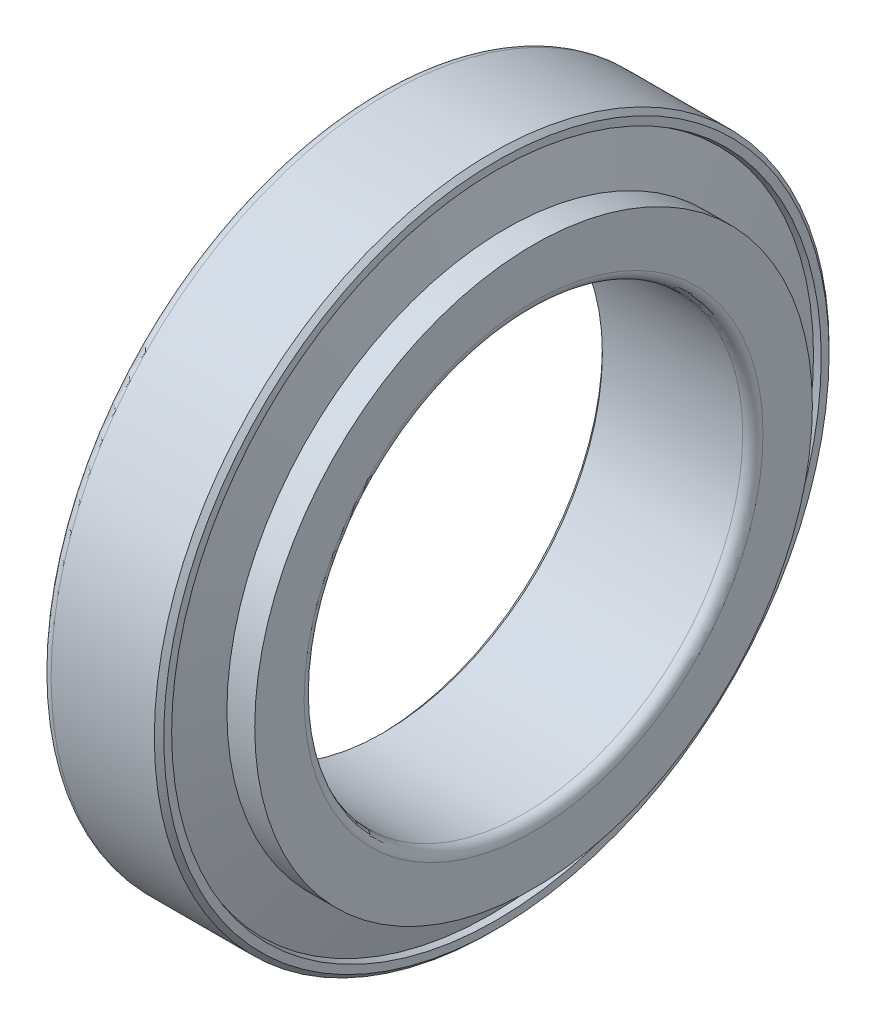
from build123d import *


with BuildPart() as part:
    # OutRacSke → OuterRace (revolve)
    with BuildSketch(Plane.XY, mode=Mode.PRIVATE) as outerrace_sk:
        with BuildLine():
            Line((-5.5, 48.133786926), (-23, 42.7835))
            Line((-23, 42.7835), (-23, 48.5))
            ThreePointArc((-23, 48.5), (-22.560660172, 49.560660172), (-21.5, 50))
            Line((-21.5, 50), (-6.2, 50))
            Line((-6.2, 50), (-5.5, 49.3))
            Line((-5.5, 49.3), (-5.5, 48.133786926))
        make_face()
    revolve(outerrace_sk.sketch.rotate(Axis((-42.5, 0, 0), (1, 0, 0)), 270), axis=Axis((-42.5, 0, 0), (1, 0, 0)))

    # RolSimSke → RollersSimplified (revolve)
    with BuildSketch(Plane.XY, mode=Mode.PRIVATE) as rollerssimplified_sk:
        Polygon((-21.5, 43.458306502), (-6.438200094, 48.063160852), (-4.135772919, 40.532260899), (-19.197572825, 35.927406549), align=None)
    revolve(rollerssimplified_sk.sketch.rotate(Axis((0, 0, 0), (-1, 0, 0)), 90), axis=Axis((0, 0, 0), (-1, 0, 0)))

    # InsRacSke → InnerRace (revolve)
    with BuildSketch(Plane.XY, mode=Mode.PRIVATE) as innerrace_sk:
        with BuildLine():
            Line((-19.306442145, 36.321156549), (-23, 36.321156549))
            Line((-23, 36.321156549), (-23, 33.2))
            Line((-23, 33.2), (-22.3, 32.5))
            Line((-22.3, 32.5), (-1.5, 32.5))
            ThreePointArc((-1.5, 32.5), (-0.439339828, 32.939339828), (0, 34))
            Line((0, 34), (0, 41.319760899))
            Line((0, 41.319760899), (-4.124260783, 41.319760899))
            Line((-4.124260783, 41.319760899), (-4.124260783, 40.532260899))
            Line((-4.124260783, 40.532260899), (-19.186060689, 35.927406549))
            Line((-19.186060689, 35.927406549), (-19.306442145, 36.321156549))
        make_face()
    revolve(innerrace_sk.sketch.rotate(Axis((-42.5, 0, 0), (1, 0, 0)), 270), axis=Axis((-42.5, 0, 0), (1, 0, 0)))


solid = part.part
